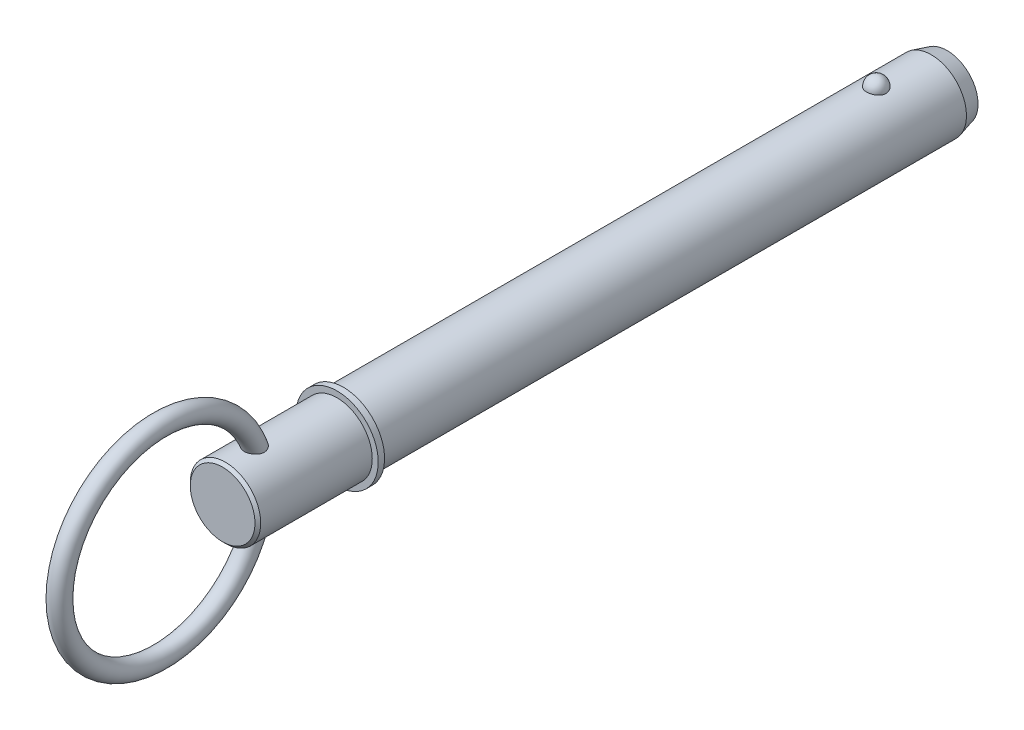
ISO-10303-21;
HEADER;
FILE_DESCRIPTION(('STEP AP214'),'2;1');
FILE_NAME('part.step','',(''),(''),'','','');
FILE_SCHEMA(('AUTOMOTIVE_DESIGN { 1 0 10303 214 1 1 1 1 }'));
ENDSEC;
DATA;
#1=APPLICATION_CONTEXT('core data for automotive mechanical design processes');
#2=APPLICATION_PROTOCOL_DEFINITION('international standard','automotive_design',2000,#1);
#3=PRODUCT_CONTEXT('',#1,'mechanical');
#4=PRODUCT('Part','Part','',(#3));
#5=PRODUCT_RELATED_PRODUCT_CATEGORY('part','',(#4));
#6=PRODUCT_DEFINITION_FORMATION('','',#4);
#7=PRODUCT_DEFINITION_CONTEXT('part definition',#1,'design');
#8=PRODUCT_DEFINITION('design','',#6,#7);
#9=PRODUCT_DEFINITION_SHAPE('','',#8);
#10=(LENGTH_UNIT() NAMED_UNIT(*) SI_UNIT(.MILLI.,.METRE.));
#11=(NAMED_UNIT(*) PLANE_ANGLE_UNIT() SI_UNIT($,.RADIAN.));
#12=(NAMED_UNIT(*) SI_UNIT($,.STERADIAN.) SOLID_ANGLE_UNIT());
#13=UNCERTAINTY_MEASURE_WITH_UNIT(LENGTH_MEASURE(1.E-05),#10,'distance_accuracy_value','');
#14=(GEOMETRIC_REPRESENTATION_CONTEXT(3) GLOBAL_UNCERTAINTY_ASSIGNED_CONTEXT((#13)) GLOBAL_UNIT_ASSIGNED_CONTEXT((#10,
#11,#12)) REPRESENTATION_CONTEXT('',''));
#15=CARTESIAN_POINT('',(0.,0.,0.));
#16=DIRECTION('',(0.,0.,1.));
#17=DIRECTION('',(1.,0.,0.));
#18=AXIS2_PLACEMENT_3D('',#15,#16,#17);
#19=CARTESIAN_POINT('',(0.,0.,165.1));
#20=DIRECTION('',(0.,0.,-1.));
#21=DIRECTION('',(-1.,0.,0.));
#22=AXIS2_PLACEMENT_3D('',#19,#20,#21);
#23=CYLINDRICAL_SURFACE('',#22,11.115);
#24=CARTESIAN_POINT('',(3.04058343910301,10.6910278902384,-3.07000000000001));
#25=CARTESIAN_POINT('',(3.04058039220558,10.6910304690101,-2.89837124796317));
#26=CARTESIAN_POINT('',(3.02657193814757,10.6950430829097,-2.7267036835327));
#27=CARTESIAN_POINT('',(2.97087341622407,10.7106465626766,-2.38822964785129));
#28=CARTESIAN_POINT('',(2.92917240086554,10.7222404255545,-2.221425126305));
#29=CARTESIAN_POINT('',(2.81915317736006,10.751689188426,-1.89750816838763));
#30=CARTESIAN_POINT('',(2.75084669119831,10.7695413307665,-1.74039149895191));
#31=CARTESIAN_POINT('',(2.58932284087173,10.809510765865,-1.44013959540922));
#32=CARTESIAN_POINT('',(2.49610617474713,10.8316279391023,-1.29700396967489));
#33=CARTESIAN_POINT('',(2.28659317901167,10.877786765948,-1.02797591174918));
#34=CARTESIAN_POINT('',(2.17018825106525,10.9018371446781,-0.902169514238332));
#35=CARTESIAN_POINT('',(1.91759004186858,10.9490888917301,-0.672091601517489));
#36=CARTESIAN_POINT('',(1.78139672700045,10.9722902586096,-0.567820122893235));
#37=CARTESIAN_POINT('',(1.49327884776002,11.0151925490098,-0.383992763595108));
#38=CARTESIAN_POINT('',(1.34139928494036,11.034903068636,-0.304368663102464));
#39=CARTESIAN_POINT('',(1.02584823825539,11.0686948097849,-0.1717314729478));
#40=CARTESIAN_POINT('',(0.86217801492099,11.0827766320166,-0.118715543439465));
#41=CARTESIAN_POINT('',(0.530748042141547,11.1035404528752,-0.0415304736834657));
#42=CARTESIAN_POINT('',(0.363109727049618,11.1103474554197,-0.0168734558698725));
#43=CARTESIAN_POINT('',(0.0259327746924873,11.1162480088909,0.00453486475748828));
#44=CARTESIAN_POINT('',(-0.143605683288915,11.1153422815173,0.00128877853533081));
#45=CARTESIAN_POINT('',(-0.477280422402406,11.1059854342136,-0.0327676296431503));
#46=CARTESIAN_POINT('',(-0.641459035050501,11.0976393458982,-0.0631942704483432));
#47=CARTESIAN_POINT('',(-0.962236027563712,11.0744390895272,-0.15022094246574));
#48=CARTESIAN_POINT('',(-1.11883427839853,11.0595848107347,-0.206821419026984));
#49=CARTESIAN_POINT('',(-1.4210461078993,11.0248420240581,-0.345028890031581));
#50=CARTESIAN_POINT('',(-1.56659244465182,11.0049254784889,-0.426775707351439));
#51=CARTESIAN_POINT('',(-1.84189316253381,10.9622119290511,-0.612956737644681));
#52=CARTESIAN_POINT('',(-1.97164597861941,10.9394146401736,-0.717393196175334));
#53=CARTESIAN_POINT('',(-2.21432263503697,10.8929139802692,-0.948332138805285));
#54=CARTESIAN_POINT('',(-2.3268890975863,10.8692016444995,-1.07520847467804));
#55=CARTESIAN_POINT('',(-2.52940007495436,10.8238699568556,-1.34622145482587));
#56=CARTESIAN_POINT('',(-2.6193430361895,10.8022507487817,-1.49035928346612));
#57=CARTESIAN_POINT('',(-2.77523958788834,10.7632629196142,-1.79367507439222));
#58=CARTESIAN_POINT('',(-2.8409151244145,10.7459442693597,-1.95300253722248));
#59=CARTESIAN_POINT('',(-2.94519180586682,10.7178360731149,-2.28083009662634));
#60=CARTESIAN_POINT('',(-2.98379371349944,10.707046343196,-2.44932993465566));
#61=CARTESIAN_POINT('',(-3.03284665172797,10.6932559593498,-2.7899809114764));
#62=CARTESIAN_POINT('',(-3.04341313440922,10.6902233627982,-2.96211412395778));
#63=CARTESIAN_POINT('',(-3.03646037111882,10.6922002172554,-3.30576225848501));
#64=CARTESIAN_POINT('',(-3.0189418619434,10.6972094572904,-3.47727719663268));
#65=CARTESIAN_POINT('',(-2.95641582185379,10.7146564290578,-3.81396465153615));
#66=CARTESIAN_POINT('',(-2.91154117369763,10.7270582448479,-3.97916375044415));
#67=CARTESIAN_POINT('',(-2.79553341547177,10.7578713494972,-4.29947360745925));
#68=CARTESIAN_POINT('',(-2.72439927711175,10.7762828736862,-4.45458397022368));
#69=CARTESIAN_POINT('',(-2.55718900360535,10.8171819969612,-4.75123550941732));
#70=CARTESIAN_POINT('',(-2.46098224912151,10.8396907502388,-4.89270014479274));
#71=CARTESIAN_POINT('',(-2.24623042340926,10.8862165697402,-5.1572409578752));
#72=CARTESIAN_POINT('',(-2.12768452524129,10.9102336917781,-5.28031645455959));
#73=CARTESIAN_POINT('',(-1.87085107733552,10.9571990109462,-5.50509615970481));
#74=CARTESIAN_POINT('',(-1.73249451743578,10.9801430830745,-5.60672245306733));
#75=CARTESIAN_POINT('',(-1.44010079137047,11.0223008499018,-5.78517789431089));
#76=CARTESIAN_POINT('',(-1.28606470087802,11.0415148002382,-5.86200874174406));
#77=CARTESIAN_POINT('',(-0.968615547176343,11.0738491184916,-5.98788441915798));
#78=CARTESIAN_POINT('',(-0.805339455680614,11.0870408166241,-6.03725610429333));
#79=CARTESIAN_POINT('',(-0.47244987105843,11.1062048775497,-6.10820004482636));
#80=CARTESIAN_POINT('',(-0.302837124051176,11.11217808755,-6.12977556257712));
#81=CARTESIAN_POINT('',(0.0345765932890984,11.1162034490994,-6.14436196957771));
#82=CARTESIAN_POINT('',(0.20235372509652,11.1143988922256,-6.13788957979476));
#83=CARTESIAN_POINT('',(0.534364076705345,11.103390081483,-6.09773981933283));
#84=CARTESIAN_POINT('',(0.698597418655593,11.094186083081,-6.06406338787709));
#85=CARTESIAN_POINT('',(1.01830314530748,11.0694136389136,-5.97063285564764));
#86=CARTESIAN_POINT('',(1.17380497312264,11.0538682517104,-5.91097318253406));
#87=CARTESIAN_POINT('',(1.472484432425,11.0180608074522,-5.76723645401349));
#88=CARTESIAN_POINT('',(1.6156613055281,10.9977984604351,-5.68315789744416));
#89=CARTESIAN_POINT('',(1.88801614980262,10.9543574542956,-5.49138807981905));
#90=CARTESIAN_POINT('',(2.01695079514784,10.9311394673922,-5.38336024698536));
#91=CARTESIAN_POINT('',(2.25501495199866,10.8845248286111,-5.1473383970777));
#92=CARTESIAN_POINT('',(2.36414099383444,10.8611281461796,-5.01934088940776));
#93=CARTESIAN_POINT('',(2.56152595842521,10.8162958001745,-4.74447932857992));
#94=CARTESIAN_POINT('',(2.64940088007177,10.7948999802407,-4.59733288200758));
#95=CARTESIAN_POINT('',(2.79961494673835,10.7569242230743,-4.29001203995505));
#96=CARTESIAN_POINT('',(2.86196390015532,10.7403424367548,-4.1298426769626));
#97=CARTESIAN_POINT('',(2.95377333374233,10.715429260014,-3.82062342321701));
#98=CARTESIAN_POINT('',(2.98627018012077,10.7063495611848,-3.67252681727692));
#99=CARTESIAN_POINT('',(3.02967634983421,10.6941478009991,-3.37296350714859));
#100=CARTESIAN_POINT('',(3.04058612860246,10.6910256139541,-3.22149687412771));
#101=CARTESIAN_POINT('',(3.04058343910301,10.6910278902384,-3.07000000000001));
#102=B_SPLINE_CURVE_WITH_KNOTS('',3,(#24,#25,#26,#27,#28,#29,#30,#31,#32,#33,#34,#35,#36,#37,
#38,#39,#40,#41,#42,#43,#44,#45,#46,#47,#48,#49,#50,#51,#52,#53,#54,#55,#56,#57,#58,#59,#60,#61,
#62,#63,#64,#65,#66,#67,#68,#69,#70,#71,#72,#73,#74,#75,#76,#77,#78,#79,#80,#81,#82,#83,#84,#85,
#86,#87,#88,#89,#90,#91,#92,#93,#94,#95,#96,#97,#98,#99,#100,#101),.UNSPECIFIED.,.T.,.F.,(4,2,2,
2,2,2,2,2,2,2,2,2,2,2,2,2,2,2,2,2,2,2,2,2,2,2,2,2,2,2,2,2,2,2,2,2,2,2,4),(0.,0.514341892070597,
1.02888723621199,1.54320613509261,2.0575106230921,2.57428293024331,3.09105611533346,
3.60638589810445,4.1216606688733,4.62793159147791,5.1341551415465,5.63334381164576,
6.13254097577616,6.63456562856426,7.13663998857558,7.64804063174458,8.15947638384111,
8.6766026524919,9.19371435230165,9.70869321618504,10.223658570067,10.7361421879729,
11.2486458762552,11.7638748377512,12.2791228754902,12.7962115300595,13.3132647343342,
13.8240238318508,14.3347229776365,14.8360540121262,15.3373677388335,15.8368746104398,
16.3364121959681,16.8434736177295,17.3506237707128,17.8663484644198,18.3818748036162,
18.8358944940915,19.2899046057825),.UNSPECIFIED.);
#103=CARTESIAN_POINT('',(3.04058343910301,10.6910278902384,-3.07000000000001));
#104=VERTEX_POINT('',#103);
#105=EDGE_CURVE('E101',#104,#104,#102,.T.);
#106=ORIENTED_EDGE('',*,*,#105,.T.);
#107=EDGE_LOOP('',(#106));
#108=FACE_BOUND('',#107,.T.);
#109=CARTESIAN_POINT('',(0.,0.,-20.3999999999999));
#110=DIRECTION('',(0.,0.,-1.));
#111=DIRECTION('',(-1.,0.,0.));
#112=AXIS2_PLACEMENT_3D('',#109,#110,#111);
#113=CIRCLE('',#112,11.115);
#114=CARTESIAN_POINT('',(-11.115,0.,-20.3999999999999));
#115=VERTEX_POINT('',#114);
#116=EDGE_CURVE('E109',#115,#115,#113,.F.);
#117=ORIENTED_EDGE('',*,*,#116,.T.);
#118=EDGE_LOOP('',(#117));
#119=FACE_BOUND('',#118,.T.);
#120=CARTESIAN_POINT('',(0.,0.,165.1));
#121=DIRECTION('',(0.,0.,1.));
#122=DIRECTION('',(1.,0.,0.));
#123=AXIS2_PLACEMENT_3D('',#120,#121,#122);
#124=CIRCLE('',#123,11.115);
#125=CARTESIAN_POINT('',(11.115,0.,165.1));
#126=VERTEX_POINT('',#125);
#127=EDGE_CURVE('E107',#126,#126,#124,.T.);
#128=ORIENTED_EDGE('',*,*,#127,.F.);
#129=EDGE_LOOP('',(#128));
#130=FACE_BOUND('',#129,.T.);
#131=ADVANCED_FACE('F39',(#108,#119,#130),#23,.T.);
#132=CARTESIAN_POINT('',(0.,0.,-25.4));
#133=DIRECTION('',(0.,0.,-1.));
#134=DIRECTION('',(-1.,0.,0.));
#135=AXIS2_PLACEMENT_3D('',#132,#133,#134);
#136=PLANE('',#135);
#137=CARTESIAN_POINT('',(0.,0.,-25.4));
#138=DIRECTION('',(0.,0.,-1.));
#139=DIRECTION('',(-1.,0.,0.));
#140=AXIS2_PLACEMENT_3D('',#137,#138,#139);
#141=CIRCLE('',#140,9.77525403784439);
#142=CARTESIAN_POINT('',(-9.77525403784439,0.,-25.4));
#143=VERTEX_POINT('',#142);
#144=EDGE_CURVE('E142',#143,#143,#141,.T.);
#145=ORIENTED_EDGE('',*,*,#144,.T.);
#146=EDGE_LOOP('',(#145));
#147=FACE_BOUND('',#146,.T.);
#148=ADVANCED_FACE('F87',(#147),#136,.T.);
#149=CARTESIAN_POINT('',(0.,0.,-25.4));
#150=DIRECTION('',(0.,0.,1.));
#151=DIRECTION('',(1.,0.,0.));
#152=AXIS2_PLACEMENT_3D('',#149,#150,#151);
#153=CONICAL_SURFACE('',#152,9.77525403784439,0.261799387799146);
#154=ORIENTED_EDGE('',*,*,#116,.F.);
#155=EDGE_LOOP('',(#154));
#156=FACE_BOUND('',#155,.T.);
#157=ORIENTED_EDGE('',*,*,#144,.F.);
#158=EDGE_LOOP('',(#157));
#159=FACE_BOUND('',#158,.T.);
#160=ADVANCED_FACE('F93',(#156,#159),#153,.T.);
#161=CARTESIAN_POINT('',(0.,11.115,-3.07000000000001));
#162=DIRECTION('',(0.,1.,0.));
#163=DIRECTION('',(0.,0.,1.));
#164=AXIS2_PLACEMENT_3D('',#161,#162,#163);
#165=SPHERICAL_SURFACE('',#164,3.07);
#166=ORIENTED_EDGE('',*,*,#105,.F.);
#167=EDGE_LOOP('',(#166));
#168=FACE_BOUND('',#167,.T.);
#169=ADVANCED_FACE('F112',(#168),#165,.T.);
#170=CARTESIAN_POINT('',(0.,0.,165.1));
#171=DIRECTION('',(0.,0.,-1.));
#172=DIRECTION('',(-1.,0.,0.));
#173=AXIS2_PLACEMENT_3D('',#170,#171,#172);
#174=PLANE('',#173);
#175=ORIENTED_EDGE('',*,*,#127,.T.);
#176=EDGE_LOOP('',(#175));
#177=FACE_BOUND('',#176,.T.);
#178=CARTESIAN_POINT('',(0.,0.,165.1));
#179=DIRECTION('',(0.,0.,-1.));
#180=DIRECTION('',(-1.,0.,0.));
#181=AXIS2_PLACEMENT_3D('',#178,#179,#180);
#182=CIRCLE('',#181,13.);
#183=CARTESIAN_POINT('',(-13.,0.,165.1));
#184=VERTEX_POINT('',#183);
#185=EDGE_CURVE('E108',#184,#184,#182,.T.);
#186=ORIENTED_EDGE('',*,*,#185,.T.);
#187=EDGE_LOOP('',(#186));
#188=FACE_BOUND('',#187,.T.);
#189=ADVANCED_FACE('F116',(#177,#188),#174,.T.);
#190=CARTESIAN_POINT('',(0.,0.,33.7287874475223));
#191=DIRECTION('',(0.,0.,-1.));
#192=DIRECTION('',(-1.,0.,0.));
#193=AXIS2_PLACEMENT_3D('',#190,#191,#192);
#194=CYLINDRICAL_SURFACE('',#193,13.);
#195=CARTESIAN_POINT('',(0.,0.,167.1));
#196=DIRECTION('',(0.,0.,-1.));
#197=DIRECTION('',(-1.,0.,0.));
#198=AXIS2_PLACEMENT_3D('',#195,#196,#197);
#199=CIRCLE('',#198,13.);
#200=CARTESIAN_POINT('',(-13.,0.,167.1));
#201=VERTEX_POINT('',#200);
#202=EDGE_CURVE('E133',#201,#201,#199,.T.);
#203=ORIENTED_EDGE('',*,*,#202,.T.);
#204=EDGE_LOOP('',(#203));
#205=FACE_BOUND('',#204,.T.);
#206=ORIENTED_EDGE('',*,*,#185,.F.);
#207=EDGE_LOOP('',(#206));
#208=FACE_BOUND('',#207,.T.);
#209=ADVANCED_FACE('F120',(#205,#208),#194,.T.);
#210=CARTESIAN_POINT('',(0.,13.,167.1));
#211=DIRECTION('',(0.,0.,1.));
#212=DIRECTION('',(1.,0.,0.));
#213=AXIS2_PLACEMENT_3D('',#210,#211,#212);
#214=PLANE('',#213);
#215=CARTESIAN_POINT('',(0.,0.,167.1));
#216=DIRECTION('',(0.,0.,1.));
#217=DIRECTION('',(1.,0.,0.));
#218=AXIS2_PLACEMENT_3D('',#215,#216,#217);
#219=CIRCLE('',#218,11.115);
#220=CARTESIAN_POINT('',(11.115,0.,167.1));
#221=VERTEX_POINT('',#220);
#222=EDGE_CURVE('E111',#221,#221,#219,.T.);
#223=ORIENTED_EDGE('',*,*,#222,.F.);
#224=EDGE_LOOP('',(#223));
#225=FACE_BOUND('',#224,.T.);
#226=ORIENTED_EDGE('',*,*,#202,.F.);
#227=EDGE_LOOP('',(#226));
#228=FACE_BOUND('',#227,.T.);
#229=ADVANCED_FACE('F84',(#225,#228),#214,.T.);
#230=CARTESIAN_POINT('',(0.,0.,203.2));
#231=DIRECTION('',(0.,0.,-1.));
#232=DIRECTION('',(-1.,0.,0.));
#233=AXIS2_PLACEMENT_3D('',#230,#231,#232);
#234=CYLINDRICAL_SURFACE('',#233,11.115);
#235=CARTESIAN_POINT('',(-1.22435852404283,-11.0473603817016,190.278419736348));
#236=CARTESIAN_POINT('',(-1.07078016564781,-11.0643805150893,190.211699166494));
#237=CARTESIAN_POINT('',(-0.911372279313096,-11.0787777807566,190.157745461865));
#238=CARTESIAN_POINT('',(-0.585451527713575,-11.1007717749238,190.076552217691));
#239=CARTESIAN_POINT('',(-0.418938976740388,-11.1083688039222,190.049311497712));
#240=CARTESIAN_POINT('',(-0.0835394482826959,-11.1159515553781,190.022121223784));
#241=CARTESIAN_POINT('',(0.0853474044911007,-11.1159376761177,190.022170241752));
#242=CARTESIAN_POINT('',(0.420723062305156,-11.1083011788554,190.049554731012));
#243=CARTESIAN_POINT('',(0.587211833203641,-11.1006784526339,190.076890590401));
#244=CARTESIAN_POINT('',(0.913189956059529,-11.0786293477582,190.15829957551));
#245=CARTESIAN_POINT('',(1.07267378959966,-11.0641977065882,190.212393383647));
#246=CARTESIAN_POINT('',(1.37994044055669,-11.0300907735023,190.346140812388));
#247=CARTESIAN_POINT('',(1.52772335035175,-11.0104155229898,190.425794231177));
#248=CARTESIAN_POINT('',(1.80679367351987,-10.9680716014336,190.608467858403));
#249=CARTESIAN_POINT('',(1.93814041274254,-10.945414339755,190.711400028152));
#250=CARTESIAN_POINT('',(2.18117403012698,-10.8995884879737,190.938212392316));
#251=CARTESIAN_POINT('',(2.29286356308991,-10.8764199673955,191.062089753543));
#252=CARTESIAN_POINT('',(2.49238969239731,-10.8324319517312,191.325992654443));
#253=CARTESIAN_POINT('',(2.58046870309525,-10.8115899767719,191.465831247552));
#254=CARTESIAN_POINT('',(2.73218762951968,-10.7742522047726,191.758691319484));
#255=CARTESIAN_POINT('',(2.7958294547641,-10.757756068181,191.911711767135));
#256=CARTESIAN_POINT('',(2.89767977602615,-10.7307723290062,192.2266092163));
#257=CARTESIAN_POINT('',(2.93586554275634,-10.7202900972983,192.388493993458));
#258=CARTESIAN_POINT('',(2.98678800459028,-10.7062139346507,192.716480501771));
#259=CARTESIAN_POINT('',(2.99951894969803,-10.7026215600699,192.882583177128));
#260=CARTESIAN_POINT('',(3.0004780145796,-10.7023530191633,193.223227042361));
#261=CARTESIAN_POINT('',(2.98743421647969,-10.7060358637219,193.397770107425));
#262=CARTESIAN_POINT('',(2.93592917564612,-10.7202719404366,193.742750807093));
#263=CARTESIAN_POINT('',(2.8974582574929,-10.7308277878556,193.913186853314));
#264=CARTESIAN_POINT('',(2.79180512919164,-10.7588257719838,194.263114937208));
#265=CARTESIAN_POINT('',(2.72213928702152,-10.776850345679,194.441811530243));
#266=CARTESIAN_POINT('',(2.5561284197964,-10.8174264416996,194.785974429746));
#267=CARTESIAN_POINT('',(2.4597569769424,-10.8399824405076,194.951427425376));
#268=CARTESIAN_POINT('',(2.23434632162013,-10.8887625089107,195.275672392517));
#269=CARTESIAN_POINT('',(2.10349593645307,-10.9151327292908,195.433192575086));
#270=CARTESIAN_POINT('',(1.81505097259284,-10.96677510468,195.721668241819));
#271=CARTESIAN_POINT('',(1.65749731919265,-10.9920488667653,195.85266371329));
#272=CARTESIAN_POINT('',(1.36197799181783,-11.0319737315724,196.051313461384));
#273=CARTESIAN_POINT('',(1.22927684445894,-11.0476896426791,196.12660092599));
#274=CARTESIAN_POINT('',(0.952979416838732,-11.0749380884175,196.254574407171));
#275=CARTESIAN_POINT('',(0.809393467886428,-11.0864745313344,196.30728154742));
#276=CARTESIAN_POINT('',(0.513954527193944,-11.1041011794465,196.387058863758));
#277=CARTESIAN_POINT('',(0.362058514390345,-11.1101594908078,196.413978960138));
#278=CARTESIAN_POINT('',(0.0557792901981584,-11.1159132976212,196.439559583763));
#279=CARTESIAN_POINT('',(-0.0986030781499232,-11.1156109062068,196.438229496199));
#280=CARTESIAN_POINT('',(-0.389768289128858,-11.1090283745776,196.408935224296));
#281=CARTESIAN_POINT('',(-0.526830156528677,-11.1033186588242,196.383512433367));
#282=CARTESIAN_POINT('',(-0.794878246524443,-11.0873547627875,196.311270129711));
#283=CARTESIAN_POINT('',(-0.925863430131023,-11.0770998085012,196.264446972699));
#284=CARTESIAN_POINT('',(-1.18354406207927,-11.0525934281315,196.149843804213));
#285=CARTESIAN_POINT('',(-1.30991621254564,-11.0382116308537,196.081371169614));
#286=CARTESIAN_POINT('',(-1.55122352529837,-11.0068962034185,195.927131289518));
#287=CARTESIAN_POINT('',(-1.66615377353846,-10.9899614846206,195.841356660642));
#288=CARTESIAN_POINT('',(-1.90024050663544,-10.9520991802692,195.64087205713));
#289=CARTESIAN_POINT('',(-2.01728342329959,-10.9309598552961,195.523737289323));
#290=CARTESIAN_POINT('',(-2.23333659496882,-10.8888735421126,195.273839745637));
#291=CARTESIAN_POINT('',(-2.33233396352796,-10.8679267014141,195.141065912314));
#292=CARTESIAN_POINT('',(-2.52607041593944,-10.8246766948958,194.840000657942));
#293=CARTESIAN_POINT('',(-2.61741570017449,-10.8027194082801,194.669462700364));
#294=CARTESIAN_POINT('',(-2.77251687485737,-10.7639568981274,194.315671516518));
#295=CARTESIAN_POINT('',(-2.8362578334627,-10.7471544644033,194.132411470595));
#296=CARTESIAN_POINT('',(-2.93668505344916,-10.7201706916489,193.746624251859));
#297=CARTESIAN_POINT('',(-2.97161961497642,-10.7104219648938,193.543594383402));
#298=CARTESIAN_POINT('',(-2.99683495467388,-10.7033740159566,193.236874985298));
#299=CARTESIAN_POINT('',(-3.00070536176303,-10.7022882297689,193.134234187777));
#300=CARTESIAN_POINT('',(-2.99908594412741,-10.7027439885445,192.929049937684));
#301=CARTESIAN_POINT('',(-2.99360154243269,-10.7042840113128,192.826506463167));
#302=CARTESIAN_POINT('',(-2.97382504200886,-10.7097936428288,192.630330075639));
#303=CARTESIAN_POINT('',(-2.9602439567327,-10.7135669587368,192.536619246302));
#304=CARTESIAN_POINT('',(-2.92480741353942,-10.723295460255,192.350932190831));
#305=CARTESIAN_POINT('',(-2.90295619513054,-10.7292495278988,192.25895510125));
#306=CARTESIAN_POINT('',(-2.8509700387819,-10.7431800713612,192.077547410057));
#307=CARTESIAN_POINT('',(-2.82083748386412,-10.7511559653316,191.988116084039));
#308=CARTESIAN_POINT('',(-2.75241691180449,-10.7688750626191,191.81264532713));
#309=CARTESIAN_POINT('',(-2.71412954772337,-10.7786181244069,191.72660562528));
#310=CARTESIAN_POINT('',(-2.59550576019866,-10.807996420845,191.491055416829));
#311=CARTESIAN_POINT('',(-2.50612224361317,-10.8292837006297,191.346173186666));
#312=CARTESIAN_POINT('',(-2.30366035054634,-10.8741467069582,191.074571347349));
#313=CARTESIAN_POINT('',(-2.19058370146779,-10.8977222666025,190.947850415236));
#314=CARTESIAN_POINT('',(-1.94442412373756,-10.9443154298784,190.716462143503));
#315=CARTESIAN_POINT('',(-1.81141354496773,-10.967334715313,190.61171820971));
#316=CARTESIAN_POINT('',(-1.52904284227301,-11.0102504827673,190.426435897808));
#317=CARTESIAN_POINT('',(-1.37968206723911,-11.0301468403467,190.345898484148));
#318=CARTESIAN_POINT('',(-1.22435852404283,-11.0473603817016,190.278419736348));
#319=B_SPLINE_CURVE_WITH_KNOTS('',3,(#235,#236,#237,#238,#239,#240,#241,#242,#243,#244,#245,
#246,#247,#248,#249,#250,#251,#252,#253,#254,#255,#256,#257,#258,#259,#260,#261,#262,#263,#264,
#265,#266,#267,#268,#269,#270,#271,#272,#273,#274,#275,#276,#277,#278,#279,#280,#281,#282,#283,
#284,#285,#286,#287,#288,#289,#290,#291,#292,#293,#294,#295,#296,#297,#298,#299,#300,#301,#302,
#303,#304,#305,#306,#307,#308,#309,#310,#311,#312,#313,#314,#315,#316,#317,#318),.UNSPECIFIED.,
.T.,.F.,(4,2,2,2,2,2,2,2,2,2,2,2,2,2,2,2,2,2,2,2,2,2,2,2,2,2,2,2,2,2,2,2,2,2,2,2,2,2,2,2,2,4),
(0.,0.504317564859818,1.00861284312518,1.51288173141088,2.01715779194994,2.52182424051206,
3.02648670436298,3.52927157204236,4.03198848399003,4.5293269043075,5.02662645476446,
5.52436944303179,6.02222485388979,6.54526169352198,7.0684976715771,7.64398785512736,
8.22004937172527,8.83633461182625,9.45168373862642,9.90997173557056,10.3678300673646,
10.8283372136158,11.2886913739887,11.7053264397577,12.1220324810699,12.5537129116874,
12.9855779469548,13.4844842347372,13.9837454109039,14.565330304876,15.1472294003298,
15.762338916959,16.0701226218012,16.3777279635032,16.6616380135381,16.9454027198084,
17.229085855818,17.5127462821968,18.0246262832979,18.5364689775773,19.0464970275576,
19.5565453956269),.UNSPECIFIED.);
#320=CARTESIAN_POINT('',(-1.22435852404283,-11.0473603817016,190.278419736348));
#321=VERTEX_POINT('',#320);
#322=EDGE_CURVE('E10',#321,#321,#319,.T.);
#323=ORIENTED_EDGE('',*,*,#322,.F.);
#324=EDGE_LOOP('',(#323));
#325=FACE_BOUND('',#324,.T.);
#326=CARTESIAN_POINT('',(-1.22435852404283,11.0473603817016,190.278419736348));
#327=CARTESIAN_POINT('',(-1.37630771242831,11.0305212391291,190.344431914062));
#328=CARTESIAN_POINT('',(-1.52254325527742,11.0111158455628,190.422938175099));
#329=CARTESIAN_POINT('',(-1.79945383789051,10.9692671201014,190.60315338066));
#330=CARTESIAN_POINT('',(-1.93013010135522,10.9468240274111,190.704860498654));
#331=CARTESIAN_POINT('',(-2.17227655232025,10.9013603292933,190.929035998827));
#332=CARTESIAN_POINT('',(-2.28373752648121,10.8783394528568,191.051514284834));
#333=CARTESIAN_POINT('',(-2.48427458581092,10.8343057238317,191.313895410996));
#334=CARTESIAN_POINT('',(-2.57335330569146,10.8132926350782,191.453796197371));
#335=CARTESIAN_POINT('',(-2.7264007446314,10.7757209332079,191.745964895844));
#336=CARTESIAN_POINT('',(-2.79054231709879,10.7591319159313,191.89813851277));
#337=CARTESIAN_POINT('',(-2.89354234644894,10.7318913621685,192.211286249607));
#338=CARTESIAN_POINT('',(-2.93239912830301,10.7212402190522,192.372260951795));
#339=CARTESIAN_POINT('',(-2.9854043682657,10.7066038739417,192.701955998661));
#340=CARTESIAN_POINT('',(-2.9990165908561,10.7027634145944,192.870768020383));
#341=CARTESIAN_POINT('',(-3.00088147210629,10.7022388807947,193.208508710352));
#342=CARTESIAN_POINT('',(-2.98912652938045,10.7055569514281,193.377437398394));
#343=CARTESIAN_POINT('',(-2.93985175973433,10.7191979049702,193.724856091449));
#344=CARTESIAN_POINT('',(-2.90036626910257,10.7300544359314,193.903044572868));
#345=CARTESIAN_POINT('',(-2.79555002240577,10.7578360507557,194.251215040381));
#346=CARTESIAN_POINT('',(-2.73019988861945,10.774765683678,194.421190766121));
#347=CARTESIAN_POINT('',(-2.56762574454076,10.8147227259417,194.765784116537));
#348=CARTESIAN_POINT('',(-2.46786230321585,10.838191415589,194.939157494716));
#349=CARTESIAN_POINT('',(-2.24100420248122,10.8873575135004,195.266686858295));
#350=CARTESIAN_POINT('',(-2.11391925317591,10.9130541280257,195.420849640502));
#351=CARTESIAN_POINT('',(-1.85542700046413,10.9597063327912,195.682735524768));
#352=CARTESIAN_POINT('',(-1.727583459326,10.9807909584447,195.793955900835));
#353=CARTESIAN_POINT('',(-1.4548993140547,11.0202250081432,195.99412236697));
#354=CARTESIAN_POINT('',(-1.31006770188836,11.0385758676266,196.083080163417));
#355=CARTESIAN_POINT('',(-1.08171164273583,11.0625084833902,196.1963702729));
#356=CARTESIAN_POINT('',(-1.00332234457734,11.069914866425,196.230896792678));
#357=CARTESIAN_POINT('',(-0.843525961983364,11.0832350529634,196.292391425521));
#358=CARTESIAN_POINT('',(-0.762120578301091,11.0891496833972,196.319363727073));
#359=CARTESIAN_POINT('',(-0.597014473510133,11.0992628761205,196.36518193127));
#360=CARTESIAN_POINT('',(-0.513315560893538,11.1034627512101,196.384034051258));
#361=CARTESIAN_POINT('',(-0.344374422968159,11.1099851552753,196.413209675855));
#362=CARTESIAN_POINT('',(-0.259132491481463,11.1123080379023,196.423534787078));
#363=CARTESIAN_POINT('',(-0.100838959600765,11.114780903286,196.434519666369));
#364=CARTESIAN_POINT('',(-0.0278735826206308,11.1152042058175,196.436395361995));
#365=CARTESIAN_POINT('',(0.117962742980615,11.1146132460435,196.433773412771));
#366=CARTESIAN_POINT('',(0.1908336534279,11.1135985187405,196.429273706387));
#367=CARTESIAN_POINT('',(0.335842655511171,11.110161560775,196.413978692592));
#368=CARTESIAN_POINT('',(0.407981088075,11.1077400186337,196.403186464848));
#369=CARTESIAN_POINT('',(0.551029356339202,11.1015643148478,196.375503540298));
#370=CARTESIAN_POINT('',(0.621938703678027,11.0978096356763,196.358610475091));
#371=CARTESIAN_POINT('',(0.825381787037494,11.0851145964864,196.301054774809));
#372=CARTESIAN_POINT('',(0.955713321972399,11.0745538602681,196.252705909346));
#373=CARTESIAN_POINT('',(1.20733127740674,11.0499605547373,196.137325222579));
#374=CARTESIAN_POINT('',(1.32861527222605,11.0359270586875,196.070288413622));
#375=CARTESIAN_POINT('',(1.57344360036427,11.0038352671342,195.911843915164));
#376=CARTESIAN_POINT('',(1.69572941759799,10.9855025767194,195.818551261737));
#377=CARTESIAN_POINT('',(1.92565215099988,10.9475431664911,195.615650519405));
#378=CARTESIAN_POINT('',(2.03328016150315,10.9279156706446,195.506032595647));
#379=CARTESIAN_POINT('',(2.25048911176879,10.8854412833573,195.25299112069));
#380=CARTESIAN_POINT('',(2.35710396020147,10.8626332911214,195.107010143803));
#381=CARTESIAN_POINT('',(2.54757318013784,10.8195493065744,194.800478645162));
#382=CARTESIAN_POINT('',(2.6314105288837,10.799275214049,194.639917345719));
#383=CARTESIAN_POINT('',(2.78342312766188,10.7611645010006,194.287827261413));
#384=CARTESIAN_POINT('',(2.84851472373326,10.7439117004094,194.094893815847));
#385=CARTESIAN_POINT('',(2.94562652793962,10.7177011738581,193.700130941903));
#386=CARTESIAN_POINT('',(2.97764942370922,10.7087427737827,193.49830223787));
#387=CARTESIAN_POINT('',(2.99864828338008,10.7028651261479,193.195989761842));
#388=CARTESIAN_POINT('',(3.00125529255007,10.7021342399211,193.096378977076));
#389=CARTESIAN_POINT('',(2.99763044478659,10.7031517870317,192.897345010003));
#390=CARTESIAN_POINT('',(2.99140295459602,10.704898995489,192.797921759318));
#391=CARTESIAN_POINT('',(2.9699008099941,10.710883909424,192.600179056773));
#392=CARTESIAN_POINT('',(2.95463019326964,10.7151205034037,192.501859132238));
#393=CARTESIAN_POINT('',(2.91493260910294,10.7259879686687,192.307219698));
#394=CARTESIAN_POINT('',(2.89050674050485,10.7326185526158,192.210899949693));
#395=CARTESIAN_POINT('',(2.83556656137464,10.7472556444,192.031222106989));
#396=CARTESIAN_POINT('',(2.80596337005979,10.7550439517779,191.947566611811));
#397=CARTESIAN_POINT('',(2.73953102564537,10.7721572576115,191.783300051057));
#398=CARTESIAN_POINT('',(2.70269935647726,10.7814827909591,191.702690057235));
#399=CARTESIAN_POINT('',(2.62203440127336,10.8013833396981,191.545273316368));
#400=CARTESIAN_POINT('',(2.57820565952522,10.8119575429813,191.468464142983));
#401=CARTESIAN_POINT('',(2.48382482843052,10.8340293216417,191.319223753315));
#402=CARTESIAN_POINT('',(2.43327032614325,10.8455272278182,191.246794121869));
#403=CARTESIAN_POINT('',(2.27895739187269,10.879345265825,191.045992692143));
#404=CARTESIAN_POINT('',(2.16717186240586,10.9023791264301,190.923764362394));
#405=CARTESIAN_POINT('',(1.92442677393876,10.9478318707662,190.700151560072));
#406=CARTESIAN_POINT('',(1.79346836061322,10.9702507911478,190.598765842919));
#407=CARTESIAN_POINT('',(1.51657151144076,11.0119360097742,190.419564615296));
#408=CARTESIAN_POINT('',(1.37069187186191,11.0312139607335,190.341661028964));
#409=CARTESIAN_POINT('',(1.06764402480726,11.0646548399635,190.210680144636));
#410=CARTESIAN_POINT('',(0.910475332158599,11.0788175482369,190.157603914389));
#411=CARTESIAN_POINT('',(0.587492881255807,11.1006548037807,190.07697871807));
#412=CARTESIAN_POINT('',(0.421604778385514,11.1082585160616,190.049708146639));
#413=CARTESIAN_POINT('',(0.0874262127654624,11.1159127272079,190.022259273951));
#414=CARTESIAN_POINT('',(-0.0808643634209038,11.1159628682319,190.02208225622));
#415=CARTESIAN_POINT('',(-0.416252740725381,11.1084780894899,190.048918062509));
#416=CARTESIAN_POINT('',(-0.583334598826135,11.1008914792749,190.076116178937));
#417=CARTESIAN_POINT('',(-0.910355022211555,11.0788693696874,190.157401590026));
#418=CARTESIAN_POINT('',(-1.07029370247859,11.064433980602,190.211488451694));
#419=CARTESIAN_POINT('',(-1.22435852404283,11.0473603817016,190.278419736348));
#420=B_SPLINE_CURVE_WITH_KNOTS('',3,(#326,#327,#328,#329,#330,#331,#332,#333,#334,#335,#336,
#337,#338,#339,#340,#341,#342,#343,#344,#345,#346,#347,#348,#349,#350,#351,#352,#353,#354,#355,
#356,#357,#358,#359,#360,#361,#362,#363,#364,#365,#366,#367,#368,#369,#370,#371,#372,#373,#374,
#375,#376,#377,#378,#379,#380,#381,#382,#383,#384,#385,#386,#387,#388,#389,#390,#391,#392,#393,
#394,#395,#396,#397,#398,#399,#400,#401,#402,#403,#404,#405,#406,#407,#408,#409,#410,#411,#412,
#413,#414,#415,#416,#417,#418,#419),.UNSPECIFIED.,.T.,.F.,(4,2,2,2,2,2,2,2,2,2,2,2,2,2,2,2,2,2,
2,2,2,2,2,2,2,2,2,2,2,2,2,2,2,2,2,2,2,2,2,2,2,2,2,2,2,2,4),(0.,0.498977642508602,
0.997916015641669,1.49709295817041,1.99621111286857,2.49180514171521,2.98743199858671,
3.4934712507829,3.99966216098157,4.54591839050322,5.09258465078,5.69407889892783,
6.29535972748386,6.80565832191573,7.31568801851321,7.57328514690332,7.83073916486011,
8.08799570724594,8.34520376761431,8.56389164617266,8.78265025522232,9.00130188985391,
9.22003849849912,9.63638938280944,10.0528514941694,10.5157946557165,10.9790178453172,
11.5234572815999,12.068302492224,12.6784825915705,13.2886130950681,13.5872082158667,
13.8856557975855,14.1839702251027,14.4822488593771,14.7491407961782,15.016125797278,
15.282938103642,15.5498463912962,16.0489312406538,16.5479862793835,17.0451454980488,
17.542326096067,18.0448111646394,18.5473200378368,19.0532532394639,19.5591782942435),.UNSPECIFIED.);
#421=CARTESIAN_POINT('',(-1.22435852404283,11.0473603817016,190.278419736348));
#422=VERTEX_POINT('',#421);
#423=EDGE_CURVE('E51',#422,#422,#420,.T.);
#424=ORIENTED_EDGE('',*,*,#423,.F.);
#425=EDGE_LOOP('',(#424));
#426=FACE_BOUND('',#425,.T.);
#427=CARTESIAN_POINT('',(0.,0.,202.3));
#428=DIRECTION('',(0.,0.,-1.));
#429=DIRECTION('',(-1.,0.,0.));
#430=AXIS2_PLACEMENT_3D('',#427,#428,#429);
#431=CIRCLE('',#430,11.115);
#432=CARTESIAN_POINT('',(-11.115,0.,202.3));
#433=VERTEX_POINT('',#432);
#434=EDGE_CURVE('E63',#433,#433,#431,.T.);
#435=ORIENTED_EDGE('',*,*,#434,.T.);
#436=EDGE_LOOP('',(#435));
#437=FACE_BOUND('',#436,.T.);
#438=ORIENTED_EDGE('',*,*,#222,.T.);
#439=EDGE_LOOP('',(#438));
#440=FACE_BOUND('',#439,.T.);
#441=ADVANCED_FACE('F68',(#325,#426,#437,#440),#234,.T.);
#442=CARTESIAN_POINT('',(0.,0.,203.2));
#443=DIRECTION('',(0.,0.,-1.));
#444=DIRECTION('',(-1.,0.,0.));
#445=AXIS2_PLACEMENT_3D('',#442,#443,#444);
#446=PLANE('',#445);
#447=CARTESIAN_POINT('',(0.,0.,203.2));
#448=DIRECTION('',(0.,0.,-1.));
#449=DIRECTION('',(-1.,0.,0.));
#450=AXIS2_PLACEMENT_3D('',#447,#448,#449);
#451=CIRCLE('',#450,10.2149999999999);
#452=CARTESIAN_POINT('',(-10.2149999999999,0.,203.2));
#453=VERTEX_POINT('',#452);
#454=EDGE_CURVE('E57',#453,#453,#451,.F.);
#455=ORIENTED_EDGE('',*,*,#454,.T.);
#456=EDGE_LOOP('',(#455));
#457=FACE_BOUND('',#456,.T.);
#458=ADVANCED_FACE('F75',(#457),#446,.F.);
#459=CARTESIAN_POINT('',(0.,0.,202.3));
#460=DIRECTION('',(0.,0.,-1.));
#461=DIRECTION('',(-1.,0.,0.));
#462=AXIS2_PLACEMENT_3D('',#459,#460,#461);
#463=CONICAL_SURFACE('',#462,11.115,0.785398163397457);
#464=ORIENTED_EDGE('',*,*,#454,.F.);
#465=EDGE_LOOP('',(#464));
#466=FACE_BOUND('',#465,.T.);
#467=ORIENTED_EDGE('',*,*,#434,.F.);
#468=EDGE_LOOP('',(#467));
#469=FACE_BOUND('',#468,.T.);
#470=ADVANCED_FACE('F41',(#466,#469),#463,.T.);
#471=CARTESIAN_POINT('',(0.,0.,222.95));
#472=DIRECTION('',(1.,0.,0.));
#473=DIRECTION('',(0.,0.,-1.));
#474=AXIS2_PLACEMENT_3D('',#471,#472,#473);
#475=TOROIDAL_SURFACE('',#474,31.75,3.);
#476=ORIENTED_EDGE('',*,*,#322,.T.);
#477=EDGE_LOOP('',(#476));
#478=FACE_BOUND('',#477,.T.);
#479=ORIENTED_EDGE('',*,*,#423,.T.);
#480=EDGE_LOOP('',(#479));
#481=FACE_BOUND('',#480,.T.);
#482=ADVANCED_FACE('F72',(#478,#481),#475,.T.);
#483=CLOSED_SHELL('',(#131,#148,#160,#169,#189,#209,#229,#441,#458,#470,#482));
#484=MANIFOLD_SOLID_BREP('B2',#483);
#485=ADVANCED_BREP_SHAPE_REPRESENTATION('',(#18,#484),#14);
#486=SHAPE_DEFINITION_REPRESENTATION(#9,#485);
ENDSEC;
END-ISO-10303-21;
